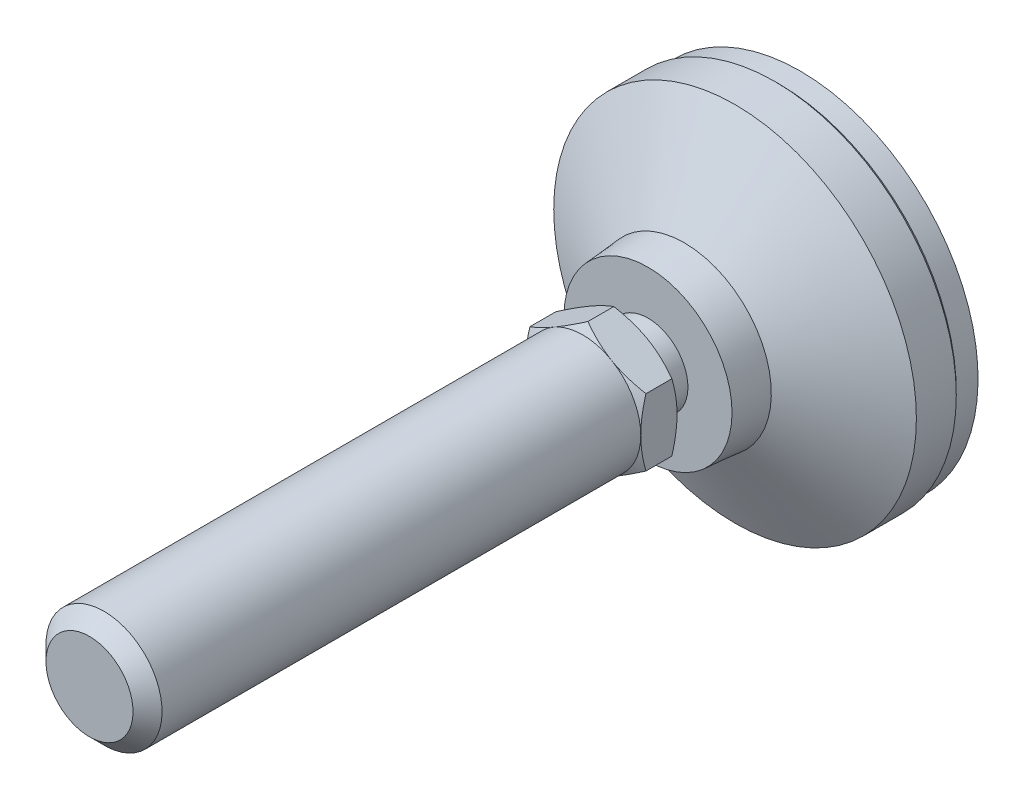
ISO-10303-21;
HEADER;
FILE_DESCRIPTION(('STEP AP214'),'2;1');
FILE_NAME('part.step','',(''),(''),'','','');
FILE_SCHEMA(('AUTOMOTIVE_DESIGN { 1 0 10303 214 1 1 1 1 }'));
ENDSEC;
DATA;
#1=APPLICATION_CONTEXT('core data for automotive mechanical design processes');
#2=APPLICATION_PROTOCOL_DEFINITION('international standard','automotive_design',2000,#1);
#3=PRODUCT_CONTEXT('',#1,'mechanical');
#4=PRODUCT('Part','Part','',(#3));
#5=PRODUCT_RELATED_PRODUCT_CATEGORY('part','',(#4));
#6=PRODUCT_DEFINITION_FORMATION('','',#4);
#7=PRODUCT_DEFINITION_CONTEXT('part definition',#1,'design');
#8=PRODUCT_DEFINITION('design','',#6,#7);
#9=PRODUCT_DEFINITION_SHAPE('','',#8);
#10=(LENGTH_UNIT() NAMED_UNIT(*) SI_UNIT(.MILLI.,.METRE.));
#11=(NAMED_UNIT(*) PLANE_ANGLE_UNIT() SI_UNIT($,.RADIAN.));
#12=(NAMED_UNIT(*) SI_UNIT($,.STERADIAN.) SOLID_ANGLE_UNIT());
#13=UNCERTAINTY_MEASURE_WITH_UNIT(LENGTH_MEASURE(1.E-05),#10,'distance_accuracy_value','');
#14=(GEOMETRIC_REPRESENTATION_CONTEXT(3) GLOBAL_UNCERTAINTY_ASSIGNED_CONTEXT((#13)) GLOBAL_UNIT_ASSIGNED_CONTEXT((#10,
#11,#12)) REPRESENTATION_CONTEXT('',''));
#15=CARTESIAN_POINT('',(0.,0.,0.));
#16=DIRECTION('',(0.,0.,1.));
#17=DIRECTION('',(1.,0.,0.));
#18=AXIS2_PLACEMENT_3D('',#15,#16,#17);
#19=CARTESIAN_POINT('',(0.,-5.50000000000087,24.9999999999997));
#20=DIRECTION('',(0.,0.,-1.));
#21=DIRECTION('',(0.,1.,0.));
#22=AXIS2_PLACEMENT_3D('',#19,#20,#21);
#23=PLANE('',#22);
#24=CARTESIAN_POINT('',(0.,0.,24.9999999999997));
#25=DIRECTION('',(0.,0.,-1.));
#26=DIRECTION('',(0.,1.,0.));
#27=AXIS2_PLACEMENT_3D('',#24,#25,#26);
#28=CIRCLE('',#27,8.00000000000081);
#29=CARTESIAN_POINT('',(-4.00000000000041,6.92820323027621,24.9999999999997));
#30=VERTEX_POINT('',#29);
#31=CARTESIAN_POINT('',(-8.00000000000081,0.,24.9999999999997));
#32=VERTEX_POINT('',#31);
#33=EDGE_CURVE('E9',#30,#32,#28,.F.);
#34=ORIENTED_EDGE('',*,*,#33,.F.);
#35=CARTESIAN_POINT('',(4.,6.92820323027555,24.9999999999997));
#36=VERTEX_POINT('',#35);
#37=EDGE_CURVE('E18',#36,#30,#28,.F.);
#38=ORIENTED_EDGE('',*,*,#37,.F.);
#39=CARTESIAN_POINT('',(8.00000000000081,0.,24.9999999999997));
#40=VERTEX_POINT('',#39);
#41=EDGE_CURVE('E125',#40,#36,#28,.F.);
#42=ORIENTED_EDGE('',*,*,#41,.F.);
#43=CARTESIAN_POINT('',(0.,0.,24.9999999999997));
#44=DIRECTION('',(0.,0.,1.));
#45=DIRECTION('',(0.,-1.,0.));
#46=AXIS2_PLACEMENT_3D('',#43,#44,#45);
#47=CIRCLE('',#46,8.00000000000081);
#48=CARTESIAN_POINT('',(4.00000000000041,-6.92820323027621,24.9999999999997));
#49=VERTEX_POINT('',#48);
#50=EDGE_CURVE('E614',#49,#40,#47,.T.);
#51=ORIENTED_EDGE('',*,*,#50,.F.);
#52=CARTESIAN_POINT('',(-4.00000000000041,-6.92820323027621,24.9999999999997));
#53=VERTEX_POINT('',#52);
#54=EDGE_CURVE('E616',#53,#49,#28,.F.);
#55=ORIENTED_EDGE('',*,*,#54,.F.);
#56=EDGE_CURVE('E23',#32,#53,#28,.F.);
#57=ORIENTED_EDGE('',*,*,#56,.F.);
#58=EDGE_LOOP('',(#34,#38,#42,#51,#55,#57));
#59=FACE_BOUND('',#58,.T.);
#60=CARTESIAN_POINT('',(0.,0.,24.9999999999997));
#61=DIRECTION('',(0.,0.,-1.));
#62=DIRECTION('',(0.,1.,0.));
#63=AXIS2_PLACEMENT_3D('',#60,#61,#62);
#64=CIRCLE('',#63,5.50000000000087);
#65=CARTESIAN_POINT('',(0.,5.50000000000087,24.9999999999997));
#66=VERTEX_POINT('',#65);
#67=EDGE_CURVE('E229',#66,#66,#64,.T.);
#68=ORIENTED_EDGE('',*,*,#67,.F.);
#69=EDGE_LOOP('',(#68));
#70=FACE_BOUND('',#69,.T.);
#71=ADVANCED_FACE('F14',(#59,#70),#23,.T.);
#72=CARTESIAN_POINT('',(0.,0.,2.));
#73=DIRECTION('',(0.,0.,-1.));
#74=DIRECTION('',(0.,1.,0.));
#75=AXIS2_PLACEMENT_3D('',#72,#73,#74);
#76=CYLINDRICAL_SURFACE('',#75,5.50000000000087);
#77=CARTESIAN_POINT('',(0.,0.,21.));
#78=DIRECTION('',(0.,0.,-1.));
#79=DIRECTION('',(0.,1.,0.));
#80=AXIS2_PLACEMENT_3D('',#77,#78,#79);
#81=CIRCLE('',#80,5.50000000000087);
#82=CARTESIAN_POINT('',(0.,5.50000000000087,21.));
#83=VERTEX_POINT('',#82);
#84=EDGE_CURVE('E232',#83,#83,#81,.T.);
#85=ORIENTED_EDGE('',*,*,#84,.F.);
#86=EDGE_LOOP('',(#85));
#87=FACE_BOUND('',#86,.T.);
#88=ORIENTED_EDGE('',*,*,#67,.T.);
#89=EDGE_LOOP('',(#88));
#90=FACE_BOUND('',#89,.T.);
#91=ADVANCED_FACE('F296',(#87,#90),#76,.T.);
#92=CARTESIAN_POINT('',(0.,-5.50000000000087,21.));
#93=DIRECTION('',(0.,0.,1.));
#94=DIRECTION('',(0.,-1.,0.));
#95=AXIS2_PLACEMENT_3D('',#92,#93,#94);
#96=PLANE('',#95);
#97=ORIENTED_EDGE('',*,*,#84,.T.);
#98=EDGE_LOOP('',(#97));
#99=FACE_BOUND('',#98,.T.);
#100=CARTESIAN_POINT('',(0.,0.,21.));
#101=DIRECTION('',(0.,0.,1.));
#102=DIRECTION('',(0.,-1.,0.));
#103=AXIS2_PLACEMENT_3D('',#100,#101,#102);
#104=CIRCLE('',#103,11.5833333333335);
#105=CARTESIAN_POINT('',(0.,-11.5833333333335,21.));
#106=VERTEX_POINT('',#105);
#107=EDGE_CURVE('E235',#106,#106,#104,.T.);
#108=ORIENTED_EDGE('',*,*,#107,.T.);
#109=EDGE_LOOP('',(#108));
#110=FACE_BOUND('',#109,.T.);
#111=ADVANCED_FACE('F199',(#99,#110),#96,.T.);
#112=CARTESIAN_POINT('',(0.,0.,2.));
#113=DIRECTION('',(0.,0.,-1.));
#114=DIRECTION('',(0.,1.,0.));
#115=AXIS2_PLACEMENT_3D('',#112,#113,#114);
#116=CYLINDRICAL_SURFACE('',#115,25.);
#117=CARTESIAN_POINT('',(0.,0.,3.5));
#118=DIRECTION('',(0.,0.,-1.));
#119=DIRECTION('',(0.,1.,0.));
#120=AXIS2_PLACEMENT_3D('',#117,#118,#119);
#121=CIRCLE('',#120,25.);
#122=CARTESIAN_POINT('',(0.,25.,3.5));
#123=VERTEX_POINT('',#122);
#124=EDGE_CURVE('E126',#123,#123,#121,.F.);
#125=ORIENTED_EDGE('',*,*,#124,.T.);
#126=EDGE_LOOP('',(#125));
#127=FACE_BOUND('',#126,.T.);
#128=CARTESIAN_POINT('',(0.,0.,8.9999999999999));
#129=DIRECTION('',(0.,0.,-1.));
#130=DIRECTION('',(0.,1.,0.));
#131=AXIS2_PLACEMENT_3D('',#128,#129,#130);
#132=CIRCLE('',#131,25.);
#133=CARTESIAN_POINT('',(0.,25.,8.9999999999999));
#134=VERTEX_POINT('',#133);
#135=EDGE_CURVE('E238',#134,#134,#132,.T.);
#136=ORIENTED_EDGE('',*,*,#135,.T.);
#137=EDGE_LOOP('',(#136));
#138=FACE_BOUND('',#137,.T.);
#139=ADVANCED_FACE('F275',(#127,#138),#116,.T.);
#140=CARTESIAN_POINT('',(0.,0.,16.));
#141=DIRECTION('',(0.,0.,-1.));
#142=DIRECTION('',(0.,1.,0.));
#143=AXIS2_PLACEMENT_3D('',#140,#141,#142);
#144=CONICAL_SURFACE('',#143,12.0000000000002,1.07685495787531);
#145=ORIENTED_EDGE('',*,*,#135,.F.);
#146=EDGE_LOOP('',(#145));
#147=FACE_BOUND('',#146,.T.);
#148=CARTESIAN_POINT('',(0.,0.,16.));
#149=DIRECTION('',(0.,0.,-1.));
#150=DIRECTION('',(0.,1.,0.));
#151=AXIS2_PLACEMENT_3D('',#148,#149,#150);
#152=CIRCLE('',#151,12.0000000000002);
#153=CARTESIAN_POINT('',(0.,12.0000000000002,16.));
#154=VERTEX_POINT('',#153);
#155=EDGE_CURVE('E254',#154,#154,#152,.T.);
#156=ORIENTED_EDGE('',*,*,#155,.T.);
#157=EDGE_LOOP('',(#156));
#158=FACE_BOUND('',#157,.T.);
#159=ADVANCED_FACE('F518',(#147,#158),#144,.T.);
#160=CARTESIAN_POINT('',(0.,0.,22.));
#161=DIRECTION('',(0.,0.,-1.));
#162=DIRECTION('',(0.,1.,0.));
#163=AXIS2_PLACEMENT_3D('',#160,#161,#162);
#164=CONICAL_SURFACE('',#163,11.5000000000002,0.0831412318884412);
#165=ORIENTED_EDGE('',*,*,#155,.F.);
#166=EDGE_LOOP('',(#165));
#167=FACE_BOUND('',#166,.T.);
#168=ORIENTED_EDGE('',*,*,#107,.F.);
#169=EDGE_LOOP('',(#168));
#170=FACE_BOUND('',#169,.T.);
#171=ADVANCED_FACE('F281',(#167,#170),#164,.T.);
#172=CARTESIAN_POINT('',(0.,0.,3.));
#173=DIRECTION('',(0.,0.,1.));
#174=DIRECTION('',(0.,-1.,0.));
#175=AXIS2_PLACEMENT_3D('',#172,#173,#174);
#176=CONICAL_SURFACE('',#175,24.5,0.785398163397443);
#177=ORIENTED_EDGE('',*,*,#124,.F.);
#178=EDGE_LOOP('',(#177));
#179=FACE_BOUND('',#178,.T.);
#180=CARTESIAN_POINT('',(0.,0.,3.));
#181=DIRECTION('',(0.,0.,-1.));
#182=DIRECTION('',(0.,1.,0.));
#183=AXIS2_PLACEMENT_3D('',#180,#181,#182);
#184=CIRCLE('',#183,24.5);
#185=CARTESIAN_POINT('',(0.,24.5,3.));
#186=VERTEX_POINT('',#185);
#187=EDGE_CURVE('E270',#186,#186,#184,.T.);
#188=ORIENTED_EDGE('',*,*,#187,.F.);
#189=EDGE_LOOP('',(#188));
#190=FACE_BOUND('',#189,.T.);
#191=ADVANCED_FACE('F16',(#179,#190),#176,.T.);
#192=CARTESIAN_POINT('',(0.,0.,0.));
#193=DIRECTION('',(0.,0.,1.));
#194=DIRECTION('',(0.,-1.,0.));
#195=AXIS2_PLACEMENT_3D('',#192,#193,#194);
#196=CYLINDRICAL_SURFACE('',#195,24.5);
#197=CARTESIAN_POINT('',(0.,0.,0.));
#198=DIRECTION('',(0.,0.,-1.));
#199=DIRECTION('',(0.,1.,0.));
#200=AXIS2_PLACEMENT_3D('',#197,#198,#199);
#201=CIRCLE('',#200,24.5);
#202=CARTESIAN_POINT('',(0.,24.5,0.));
#203=VERTEX_POINT('',#202);
#204=EDGE_CURVE('E226',#203,#203,#201,.T.);
#205=ORIENTED_EDGE('',*,*,#204,.F.);
#206=EDGE_LOOP('',(#205));
#207=FACE_BOUND('',#206,.T.);
#208=ORIENTED_EDGE('',*,*,#187,.T.);
#209=EDGE_LOOP('',(#208));
#210=FACE_BOUND('',#209,.T.);
#211=ADVANCED_FACE('F280',(#207,#210),#196,.T.);
#212=CARTESIAN_POINT('',(0.,0.,0.));
#213=DIRECTION('',(0.,0.,-1.));
#214=DIRECTION('',(0.,1.,0.));
#215=AXIS2_PLACEMENT_3D('',#212,#213,#214);
#216=PLANE('',#215);
#217=ORIENTED_EDGE('',*,*,#204,.T.);
#218=EDGE_LOOP('',(#217));
#219=FACE_BOUND('',#218,.T.);
#220=ADVANCED_FACE('F285',(#219),#216,.T.);
#221=CARTESIAN_POINT('',(0.,0.,24.9999999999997));
#222=DIRECTION('',(0.,0.,1.));
#223=DIRECTION('',(0.,-1.,0.));
#224=AXIS2_PLACEMENT_3D('',#221,#222,#223);
#225=CONICAL_SURFACE('',#224,8.00000000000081,1.0471975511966);
#226=CARTESIAN_POINT('',(-8.0002,4.61868668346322,25.7145978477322));
#227=CARTESIAN_POINT('',(-7.82435121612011,4.72021302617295,25.6559907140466));
#228=CARTESIAN_POINT('',(-7.64784680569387,4.82211789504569,25.6000434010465));
#229=CARTESIAN_POINT('',(-7.29340453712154,5.02675523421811,25.4942010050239));
#230=CARTESIAN_POINT('',(-7.11546609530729,5.12948804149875,25.4443085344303));
#231=CARTESIAN_POINT('',(-6.57880176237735,5.43933133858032,25.3046927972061));
#232=CARTESIAN_POINT('',(-6.21795741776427,5.64766491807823,25.2252811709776));
#233=CARTESIAN_POINT('',(-5.67796082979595,5.95943209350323,25.1321616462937));
#234=CARTESIAN_POINT('',(-5.50042181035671,6.06193429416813,25.1056345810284));
#235=CARTESIAN_POINT('',(-5.1445408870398,6.2674022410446,25.0611531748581));
#236=CARTESIAN_POINT('',(-4.96619905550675,6.37036794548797,25.0431980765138));
#237=CARTESIAN_POINT('',(-4.6092083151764,6.57647664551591,25.0163156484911));
#238=CARTESIAN_POINT('',(-4.43055998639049,6.67961930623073,25.0073780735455));
#239=CARTESIAN_POINT('',(-4.07309829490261,6.88599991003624,24.9987223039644));
#240=CARTESIAN_POINT('',(-3.89428493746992,6.9892378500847,24.9990038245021));
#241=CARTESIAN_POINT('',(-3.55998663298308,7.18224506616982,25.0081450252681));
#242=CARTESIAN_POINT('',(-3.40447809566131,7.27202796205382,25.0158896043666));
#243=CARTESIAN_POINT('',(-3.09382523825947,7.4513834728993,25.0382011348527));
#244=CARTESIAN_POINT('',(-2.93868094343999,7.54095607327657,25.0527685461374));
#245=CARTESIAN_POINT('',(-2.47384868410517,7.80932710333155,25.1063606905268));
#246=CARTESIAN_POINT('',(-2.16498351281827,7.98765049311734,25.1552686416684));
#247=CARTESIAN_POINT('',(-1.54397677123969,8.3461889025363,25.2775394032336));
#248=CARTESIAN_POINT('',(-1.23191445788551,8.52635816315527,25.3514205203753));
#249=CARTESIAN_POINT('',(-0.612443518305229,8.8840098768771,25.5191001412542));
#250=CARTESIAN_POINT('',(-0.305026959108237,9.06149691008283,25.6128592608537));
#251=CARTESIAN_POINT('',(0.000200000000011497,9.23771977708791,25.7145978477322));
#252=B_SPLINE_CURVE_WITH_KNOTS('',3,(#226,#227,#228,#229,#230,#231,#232,#233,#234,#235,#236,
#237,#238,#239,#240,#241,#242,#243,#244,#245,#246,#247,#248,#249,#250,#251),.UNSPECIFIED.,.F.,
.F.,(4,2,2,2,2,2,2,2,2,2,2,2,4),(0.,0.633973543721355,1.26821965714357,2.53934712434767,
3.1593434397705,3.77928496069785,4.39852133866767,5.01773858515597,5.55680239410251,
6.0959025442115,7.17487077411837,8.27776850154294,9.37850115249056),.UNSPECIFIED.);
#253=CARTESIAN_POINT('',(0.,9.23760430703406,25.7145311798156));
#254=VERTEX_POINT('',#253);
#255=EDGE_CURVE('E115',#30,#254,#252,.T.);
#256=ORIENTED_EDGE('',*,*,#255,.T.);
#257=CARTESIAN_POINT('',(-0.000199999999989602,9.2377197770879,25.7145978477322));
#258=CARTESIAN_POINT('',(0.175648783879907,9.13619343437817,25.6559907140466));
#259=CARTESIAN_POINT('',(0.352153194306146,9.03428856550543,25.6000434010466));
#260=CARTESIAN_POINT('',(0.706595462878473,8.82965122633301,25.4942010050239));
#261=CARTESIAN_POINT('',(0.884533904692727,8.72691841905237,25.4443085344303));
#262=CARTESIAN_POINT('',(1.42119823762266,8.4170751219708,25.3046927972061));
#263=CARTESIAN_POINT('',(1.78204258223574,8.20874154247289,25.2252811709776));
#264=CARTESIAN_POINT('',(2.32203917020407,7.89697436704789,25.1321616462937));
#265=CARTESIAN_POINT('',(2.49957818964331,7.79447216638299,25.1056345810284));
#266=CARTESIAN_POINT('',(2.85545911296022,7.58900421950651,25.0611531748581));
#267=CARTESIAN_POINT('',(3.03380094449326,7.48603851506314,25.0431980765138));
#268=CARTESIAN_POINT('',(3.39079168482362,7.27992981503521,25.0163156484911));
#269=CARTESIAN_POINT('',(3.56944001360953,7.17678715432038,25.0073780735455));
#270=CARTESIAN_POINT('',(3.92690170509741,6.97040655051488,24.9987223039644));
#271=CARTESIAN_POINT('',(4.1057150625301,6.86716861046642,24.9990038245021));
#272=CARTESIAN_POINT('',(4.44001336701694,6.67416139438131,25.0081450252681));
#273=CARTESIAN_POINT('',(4.5955219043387,6.5843784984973,25.0158896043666));
#274=CARTESIAN_POINT('',(4.90617476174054,6.40502298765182,25.0382011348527));
#275=CARTESIAN_POINT('',(5.06131905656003,6.31545038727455,25.0527685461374));
#276=CARTESIAN_POINT('',(5.52615131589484,6.04707935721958,25.1063606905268));
#277=CARTESIAN_POINT('',(5.83501648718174,5.86875596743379,25.1552686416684));
#278=CARTESIAN_POINT('',(6.45602322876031,5.51021755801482,25.2775394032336));
#279=CARTESIAN_POINT('',(6.76808554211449,5.33004829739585,25.3514205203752));
#280=CARTESIAN_POINT('',(7.38755648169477,4.97239658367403,25.5191001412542));
#281=CARTESIAN_POINT('',(7.69497304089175,4.7949095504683,25.6128592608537));
#282=CARTESIAN_POINT('',(8.0002,4.61868668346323,25.7145978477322));
#283=B_SPLINE_CURVE_WITH_KNOTS('',3,(#257,#258,#259,#260,#261,#262,#263,#264,#265,#266,#267,
#268,#269,#270,#271,#272,#273,#274,#275,#276,#277,#278,#279,#280,#281,#282),.UNSPECIFIED.,.F.,
.F.,(4,2,2,2,2,2,2,2,2,2,2,2,4),(0.,0.633973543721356,1.26821965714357,2.53934712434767,
3.1593434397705,3.77928496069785,4.39852133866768,5.01773858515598,5.55680239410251,
6.09590254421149,7.17487077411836,8.27776850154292,9.37850115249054),.UNSPECIFIED.);
#284=EDGE_CURVE('E121',#254,#36,#283,.T.);
#285=ORIENTED_EDGE('',*,*,#284,.T.);
#286=ORIENTED_EDGE('',*,*,#37,.T.);
#287=EDGE_LOOP('',(#256,#285,#286));
#288=FACE_BOUND('',#287,.T.);
#289=ADVANCED_FACE('F119',(#288),#225,.T.);
#290=CARTESIAN_POINT('',(8.,12.3641693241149,28.8836030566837));
#291=CARTESIAN_POINT('',(8.,12.0151166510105,28.7144525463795));
#292=CARTESIAN_POINT('',(8.,11.6652581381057,28.5469362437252));
#293=CARTESIAN_POINT('',(8.,10.9635007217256,28.216092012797));
#294=CARTESIAN_POINT('',(8.,10.6116015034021,28.0527647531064));
#295=CARTESIAN_POINT('',(8.,9.90350034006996,27.7303877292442));
#296=CARTESIAN_POINT('',(8.,9.54728537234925,27.571366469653));
#297=CARTESIAN_POINT('',(8.,8.83200743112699,27.2598884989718));
#298=CARTESIAN_POINT('',(8.,8.47294459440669,27.10743147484));
#299=CARTESIAN_POINT('',(8.,7.73996270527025,26.8061149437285));
#300=CARTESIAN_POINT('',(8.,7.36593332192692,26.6575223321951));
#301=CARTESIAN_POINT('',(8.,6.61348385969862,26.3716863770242));
#302=CARTESIAN_POINT('',(8.,6.23506329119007,26.2344443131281));
#303=CARTESIAN_POINT('',(8.,5.47394703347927,25.9749440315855));
#304=CARTESIAN_POINT('',(8.,5.09126192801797,25.8526551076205));
#305=CARTESIAN_POINT('',(8.,4.32041642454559,25.6270115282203));
#306=CARTESIAN_POINT('',(8.,3.93225780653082,25.5236508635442));
#307=CARTESIAN_POINT('',(8.,3.15233287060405,25.3414081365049));
#308=CARTESIAN_POINT('',(8.,2.76059814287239,25.2623945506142));
#309=CARTESIAN_POINT('',(8.,2.16946296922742,25.1655749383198));
#310=CARTESIAN_POINT('',(8.,1.97181418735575,25.1369172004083));
#311=CARTESIAN_POINT('',(8.,1.5755487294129,25.0873983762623));
#312=CARTESIAN_POINT('',(8.,1.37693214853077,25.0665365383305));
#313=CARTESIAN_POINT('',(8.,0.981572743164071,25.0332845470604));
#314=CARTESIAN_POINT('',(8.,0.784838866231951,25.0207884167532));
#315=CARTESIAN_POINT('',(8.,0.391019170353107,25.004123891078));
#316=CARTESIAN_POINT('',(8.,0.193933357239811,24.9999553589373));
#317=CARTESIAN_POINT('',(8.,-0.200238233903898,25.0000453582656));
#318=CARTESIAN_POINT('',(8.,-0.39732401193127,25.0043039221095));
#319=CARTESIAN_POINT('',(8.,-0.79114218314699,25.0211447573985));
#320=CARTESIAN_POINT('',(8.,-0.987874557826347,25.0337274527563));
#321=CARTESIAN_POINT('',(8.,-1.46199048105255,25.0738169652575));
#322=CARTESIAN_POINT('',(8.,-1.73904096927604,25.1053459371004));
#323=CARTESIAN_POINT('',(8.,-2.2910445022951,25.1831820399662));
#324=CARTESIAN_POINT('',(8.,-2.5659972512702,25.229491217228));
#325=CARTESIAN_POINT('',(8.,-3.38741855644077,25.3881299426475));
#326=CARTESIAN_POINT('',(8.,-3.93013417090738,25.5201404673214));
#327=CARTESIAN_POINT('',(8.,-4.74155771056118,25.7485350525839));
#328=CARTESIAN_POINT('',(8.,-5.01448799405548,25.830776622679));
#329=CARTESIAN_POINT('',(8.,-5.55769691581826,26.0036723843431));
#330=CARTESIAN_POINT('',(8.,-5.82797553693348,26.094326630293));
#331=CARTESIAN_POINT('',(8.,-6.36596840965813,26.2826040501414));
#332=CARTESIAN_POINT('',(8.,-6.6336835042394,26.3802248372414));
#333=CARTESIAN_POINT('',(8.,-7.16690462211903,26.5812996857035));
#334=CARTESIAN_POINT('',(8.,-7.43241066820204,26.6847536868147));
#335=CARTESIAN_POINT('',(8.,-8.04598174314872,26.9303574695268));
#336=CARTESIAN_POINT('',(8.,-8.39332346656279,27.0743105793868));
#337=CARTESIAN_POINT('',(8.,-9.08515313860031,27.3689372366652));
#338=CARTESIAN_POINT('',(8.,-9.42964092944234,27.5196111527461));
#339=CARTESIAN_POINT('',(8.,-10.116269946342,27.8263669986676));
#340=CARTESIAN_POINT('',(8.,-10.4584107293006,27.9824499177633));
#341=CARTESIAN_POINT('',(8.,-11.1406749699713,28.2989717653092));
#342=CARTESIAN_POINT('',(8.,-11.4807983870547,28.4594107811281));
#343=CARTESIAN_POINT('',(8.,-12.1596813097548,28.784007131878));
#344=CARTESIAN_POINT('',(8.,-12.4984391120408,28.9481680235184));
#345=CARTESIAN_POINT('',(8.,-13.1745126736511,29.2794354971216));
#346=CARTESIAN_POINT('',(8.,-13.5118284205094,29.4465421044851));
#347=CARTESIAN_POINT('',(8.,-14.5218661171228,29.9514748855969));
#348=CARTESIAN_POINT('',(8.,-15.1927617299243,30.2929541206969));
#349=CARTESIAN_POINT('',(8.,-16.4769705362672,30.95497524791));
#350=CARTESIAN_POINT('',(8.,-17.090560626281,31.2749823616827));
#351=CARTESIAN_POINT('',(8.,-18.3154373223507,31.9194194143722));
#352=CARTESIAN_POINT('',(8.,-18.9267238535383,32.2438494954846));
#353=CARTESIAN_POINT('',(8.,-20.146053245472,32.8953241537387));
#354=CARTESIAN_POINT('',(8.,-20.7541003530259,33.2223607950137));
#355=CARTESIAN_POINT('',(8.,-21.96871356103,33.8790985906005));
#356=CARTESIAN_POINT('',(8.,-22.5752797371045,34.2087996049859));
#357=CARTESIAN_POINT('',(8.,-23.1812970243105,34.5394996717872));
#358=B_SPLINE_CURVE_WITH_KNOTS('',3,(#290,#291,#292,#293,#294,#295,#296,#297,#298,#299,#300,
#301,#302,#303,#304,#305,#306,#307,#308,#309,#310,#311,#312,#313,#314,#315,#316,#317,#318,#319,
#320,#321,#322,#323,#324,#325,#326,#327,#328,#329,#330,#331,#332,#333,#334,#335,#336,#337,#338,
#339,#340,#341,#342,#343,#344,#345,#346,#347,#348,#349,#350,#351,#352,#353,#354,#355,#356,#357),
.UNSPECIFIED.,.F.,.F.,(4,2,2,2,2,2,2,2,2,2,2,2,2,2,2,2,2,2,2,2,2,2,2,2,2,2,2,2,2,2,2,2,2,4),(0.,
1.16364965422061,2.32748388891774,3.49772643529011,4.66791311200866,5.87516395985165,
7.08255073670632,8.28741494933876,9.49189598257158,10.6897514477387,11.2887685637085,
11.8877279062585,12.4789483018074,13.0701589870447,13.6613719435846,14.2526150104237,
15.0886578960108,15.9248165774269,17.598082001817,18.453168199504,19.3082599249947,
20.1630600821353,21.0178514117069,22.1457287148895,23.2736679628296,24.4018146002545,
25.5299838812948,26.6592809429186,27.7885877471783,30.0469242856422,32.1229772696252,
34.1990971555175,36.2703380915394,38.3414709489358),.UNSPECIFIED.);
#359=CARTESIAN_POINT('',(8.,4.61880215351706,25.7145311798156));
#360=VERTEX_POINT('',#359);
#361=EDGE_CURVE('E134',#360,#40,#358,.T.);
#362=ORIENTED_EDGE('',*,*,#361,.T.);
#363=ORIENTED_EDGE('',*,*,#41,.T.);
#364=EDGE_CURVE('E171',#36,#360,#283,.T.);
#365=ORIENTED_EDGE('',*,*,#364,.T.);
#366=EDGE_LOOP('',(#362,#363,#365));
#367=FACE_BOUND('',#366,.T.);
#368=ADVANCED_FACE('F159',(#367),#225,.T.);
#369=CARTESIAN_POINT('',(8.0002,-4.61868668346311,25.7145978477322));
#370=CARTESIAN_POINT('',(7.82435121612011,-4.72021302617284,25.6559907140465));
#371=CARTESIAN_POINT('',(7.64784680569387,-4.82211789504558,25.6000434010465));
#372=CARTESIAN_POINT('',(7.29340453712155,-5.02675523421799,25.4942010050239));
#373=CARTESIAN_POINT('',(7.1154660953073,-5.12948804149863,25.4443085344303));
#374=CARTESIAN_POINT('',(6.57880176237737,-5.4393313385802,25.3046927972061));
#375=CARTESIAN_POINT('',(6.21795741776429,-5.64766491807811,25.2252811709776));
#376=CARTESIAN_POINT('',(5.67796082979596,-5.95943209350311,25.1321616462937));
#377=CARTESIAN_POINT('',(5.50042181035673,-6.06193429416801,25.1056345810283));
#378=CARTESIAN_POINT('',(5.14454088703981,-6.26740224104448,25.0611531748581));
#379=CARTESIAN_POINT('',(4.96619905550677,-6.37036794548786,25.0431980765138));
#380=CARTESIAN_POINT('',(4.60920831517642,-6.57647664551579,25.0163156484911));
#381=CARTESIAN_POINT('',(4.43055998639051,-6.67961930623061,25.0073780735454));
#382=CARTESIAN_POINT('',(4.07309829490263,-6.88599991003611,24.9987223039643));
#383=CARTESIAN_POINT('',(3.89428493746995,-6.98923785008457,24.999003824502));
#384=CARTESIAN_POINT('',(3.55998663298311,-7.18224506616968,25.008145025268));
#385=CARTESIAN_POINT('',(3.40447809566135,-7.27202796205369,25.0158896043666));
#386=CARTESIAN_POINT('',(3.09382523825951,-7.45138347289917,25.0382011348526));
#387=CARTESIAN_POINT('',(2.93868094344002,-7.54095607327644,25.0527685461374));
#388=CARTESIAN_POINT('',(2.4738486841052,-7.80932710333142,25.1063606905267));
#389=CARTESIAN_POINT('',(2.1649835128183,-7.98765049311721,25.1552686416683));
#390=CARTESIAN_POINT('',(1.54397677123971,-8.34618890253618,25.2775394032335));
#391=CARTESIAN_POINT('',(1.23191445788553,-8.52635816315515,25.3514205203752));
#392=CARTESIAN_POINT('',(0.612443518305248,-8.88400987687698,25.5191001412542));
#393=CARTESIAN_POINT('',(0.305026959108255,-9.06149691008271,25.6128592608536));
#394=CARTESIAN_POINT('',(-0.000199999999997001,-9.23771977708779,25.7145978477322));
#395=B_SPLINE_CURVE_WITH_KNOTS('',3,(#369,#370,#371,#372,#373,#374,#375,#376,#377,#378,#379,
#380,#381,#382,#383,#384,#385,#386,#387,#388,#389,#390,#391,#392,#393,#394),.UNSPECIFIED.,.F.,
.F.,(4,2,2,2,2,2,2,2,2,2,2,2,4),(0.,0.633973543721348,1.26821965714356,2.53934712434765,
3.15934343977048,3.77928496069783,4.39852133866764,5.01773858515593,5.55680239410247,
6.09590254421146,7.17487077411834,8.27776850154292,9.37850115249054),.UNSPECIFIED.);
#396=CARTESIAN_POINT('',(8.,-4.61880215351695,25.7145311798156));
#397=VERTEX_POINT('',#396);
#398=EDGE_CURVE('E149',#397,#49,#395,.T.);
#399=ORIENTED_EDGE('',*,*,#398,.T.);
#400=ORIENTED_EDGE('',*,*,#50,.T.);
#401=EDGE_CURVE('E114',#40,#397,#358,.T.);
#402=ORIENTED_EDGE('',*,*,#401,.T.);
#403=EDGE_LOOP('',(#399,#400,#402));
#404=FACE_BOUND('',#403,.T.);
#405=ADVANCED_FACE('F163',(#404),#225,.T.);
#406=CARTESIAN_POINT('',(0.000200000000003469,-9.23771977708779,25.7145978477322));
#407=CARTESIAN_POINT('',(-0.175648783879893,-9.13619343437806,25.6559907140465));
#408=CARTESIAN_POINT('',(-0.352153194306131,-9.03428856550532,25.6000434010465));
#409=CARTESIAN_POINT('',(-0.706595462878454,-8.8296512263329,25.4942010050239));
#410=CARTESIAN_POINT('',(-0.884533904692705,-8.72691841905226,25.4443085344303));
#411=CARTESIAN_POINT('',(-1.42119823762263,-8.4170751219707,25.3046927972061));
#412=CARTESIAN_POINT('',(-1.78204258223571,-8.20874154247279,25.2252811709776));
#413=CARTESIAN_POINT('',(-2.32203917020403,-7.89697436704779,25.1321616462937));
#414=CARTESIAN_POINT('',(-2.49957818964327,-7.79447216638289,25.1056345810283));
#415=CARTESIAN_POINT('',(-2.85545911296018,-7.58900421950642,25.0611531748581));
#416=CARTESIAN_POINT('',(-3.03380094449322,-7.48603851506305,25.0431980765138));
#417=CARTESIAN_POINT('',(-3.39079168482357,-7.27992981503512,25.0163156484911));
#418=CARTESIAN_POINT('',(-3.56944001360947,-7.1767871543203,25.0073780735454));
#419=CARTESIAN_POINT('',(-3.92690170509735,-6.97040655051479,24.9987223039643));
#420=CARTESIAN_POINT('',(-4.10571506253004,-6.86716861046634,24.999003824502));
#421=CARTESIAN_POINT('',(-4.44001336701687,-6.67416139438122,25.008145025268));
#422=CARTESIAN_POINT('',(-4.59552190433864,-6.58437849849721,25.0158896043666));
#423=CARTESIAN_POINT('',(-4.90617476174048,-6.40502298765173,25.0382011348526));
#424=CARTESIAN_POINT('',(-5.06131905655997,-6.31545038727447,25.0527685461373));
#425=CARTESIAN_POINT('',(-5.52615131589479,-6.04707935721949,25.1063606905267));
#426=CARTESIAN_POINT('',(-5.8350164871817,-5.86875596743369,25.1552686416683));
#427=CARTESIAN_POINT('',(-6.45602322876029,-5.51021755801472,25.2775394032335));
#428=CARTESIAN_POINT('',(-6.76808554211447,-5.33004829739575,25.3514205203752));
#429=CARTESIAN_POINT('',(-7.38755648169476,-4.97239658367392,25.5191001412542));
#430=CARTESIAN_POINT('',(-7.69497304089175,-4.79490955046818,25.6128592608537));
#431=CARTESIAN_POINT('',(-8.0002,-4.6186866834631,25.7145978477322));
#432=B_SPLINE_CURVE_WITH_KNOTS('',3,(#406,#407,#408,#409,#410,#411,#412,#413,#414,#415,#416,
#417,#418,#419,#420,#421,#422,#423,#424,#425,#426,#427,#428,#429,#430,#431),.UNSPECIFIED.,.F.,
.F.,(4,2,2,2,2,2,2,2,2,2,2,2,4),(0.,0.633973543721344,1.26821965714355,2.53934712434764,
3.15934343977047,3.77928496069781,4.39852133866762,5.01773858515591,5.55680239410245,
6.09590254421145,7.17487077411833,8.27776850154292,9.37850115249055),.UNSPECIFIED.);
#433=CARTESIAN_POINT('',(0.,-9.23760430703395,25.7145311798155));
#434=VERTEX_POINT('',#433);
#435=EDGE_CURVE('E37',#434,#53,#432,.T.);
#436=ORIENTED_EDGE('',*,*,#435,.T.);
#437=ORIENTED_EDGE('',*,*,#54,.T.);
#438=EDGE_CURVE('E557',#49,#434,#395,.T.);
#439=ORIENTED_EDGE('',*,*,#438,.T.);
#440=EDGE_LOOP('',(#436,#437,#439));
#441=FACE_BOUND('',#440,.T.);
#442=ADVANCED_FACE('F165',(#441),#225,.T.);
#443=CARTESIAN_POINT('',(-8.,-4.61880215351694,25.7145311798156));
#444=VERTEX_POINT('',#443);
#445=EDGE_CURVE('E186',#53,#444,#432,.T.);
#446=ORIENTED_EDGE('',*,*,#445,.T.);
#447=CARTESIAN_POINT('',(-8.,12.3641693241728,28.8836030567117));
#448=CARTESIAN_POINT('',(-8.,12.0151166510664,28.7144525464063));
#449=CARTESIAN_POINT('',(-8.00000000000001,11.6652581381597,28.5469362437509));
#450=CARTESIAN_POINT('',(-8.00000000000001,10.9635007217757,28.2160920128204));
#451=CARTESIAN_POINT('',(-8.00000000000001,10.6116015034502,28.0527647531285));
#452=CARTESIAN_POINT('',(-8.00000000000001,9.90350034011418,27.730387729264));
#453=CARTESIAN_POINT('',(-8.00000000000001,9.54728537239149,27.5713664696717));
#454=CARTESIAN_POINT('',(-8.00000000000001,8.83200743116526,27.2598884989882));
#455=CARTESIAN_POINT('',(-8.00000000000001,8.47294459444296,27.1074314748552));
#456=CARTESIAN_POINT('',(-8.00000000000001,7.73996270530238,26.8061149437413));
#457=CARTESIAN_POINT('',(-8.00000000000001,7.36593332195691,26.6575223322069));
#458=CARTESIAN_POINT('',(-8.00000000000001,6.61348385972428,26.3716863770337));
#459=CARTESIAN_POINT('',(-8.,6.23506329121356,26.2344443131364));
#460=CARTESIAN_POINT('',(-8.,5.47394703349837,25.9749440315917));
#461=CARTESIAN_POINT('',(-8.00000000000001,5.09126192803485,25.8526551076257));
#462=CARTESIAN_POINT('',(-8.,4.32041642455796,25.6270115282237));
#463=CARTESIAN_POINT('',(-8.,3.9322578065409,25.5236508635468));
#464=CARTESIAN_POINT('',(-8.,3.15233287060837,25.3414081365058));
#465=CARTESIAN_POINT('',(-8.,2.76059814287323,25.2623945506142));
#466=CARTESIAN_POINT('',(-8.,2.16946296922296,25.1655749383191));
#467=CARTESIAN_POINT('',(-8.,1.97181418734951,25.1369172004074));
#468=CARTESIAN_POINT('',(-8.,1.57554872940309,25.0873983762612));
#469=CARTESIAN_POINT('',(-8.,1.37693214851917,25.0665365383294));
#470=CARTESIAN_POINT('',(-8.,0.981572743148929,25.0332845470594));
#471=CARTESIAN_POINT('',(-8.,0.784838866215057,25.0207884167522));
#472=CARTESIAN_POINT('',(-8.,0.391019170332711,25.0041238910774));
#473=CARTESIAN_POINT('',(-8.,0.193933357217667,24.999955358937));
#474=CARTESIAN_POINT('',(-8.,-0.200238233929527,25.0000453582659));
#475=CARTESIAN_POINT('',(-8.,-0.397324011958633,25.0043039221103));
#476=CARTESIAN_POINT('',(-8.,-0.7911421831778,25.0211447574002));
#477=CARTESIAN_POINT('',(-8.,-0.987874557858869,25.0337274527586));
#478=CARTESIAN_POINT('',(-8.,-1.46199048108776,25.0738169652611));
#479=CARTESIAN_POINT('',(-8.,-1.73904096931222,25.1053459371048));
#480=CARTESIAN_POINT('',(-8.,-2.29104450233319,25.1831820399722));
#481=CARTESIAN_POINT('',(-8.,-2.56599725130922,25.2294912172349));
#482=CARTESIAN_POINT('',(-8.,-3.38741855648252,25.3881299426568));
#483=CARTESIAN_POINT('',(-8.,-3.93013417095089,25.5201404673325));
#484=CARTESIAN_POINT('',(-8.,-4.74155771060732,25.7485350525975));
#485=CARTESIAN_POINT('',(-8.,-5.01448799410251,25.8307766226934));
#486=CARTESIAN_POINT('',(-8.,-5.55769691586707,26.0036723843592));
#487=CARTESIAN_POINT('',(-8.,-5.82797553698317,26.0943266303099));
#488=CARTESIAN_POINT('',(-8.,-6.36596840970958,26.2826040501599));
#489=CARTESIAN_POINT('',(-8.,-6.63368350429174,26.3802248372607));
#490=CARTESIAN_POINT('',(-8.,-7.16690462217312,26.5812996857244));
#491=CARTESIAN_POINT('',(-8.,-7.43241066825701,26.6847536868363));
#492=CARTESIAN_POINT('',(-8.,-8.04598174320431,26.9303574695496));
#493=CARTESIAN_POINT('',(-8.,-8.39332346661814,27.07431057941));
#494=CARTESIAN_POINT('',(-8.,-9.0851531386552,27.368937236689));
#495=CARTESIAN_POINT('',(-8.,-9.42964092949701,27.5196111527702));
#496=CARTESIAN_POINT('',(-8.,-10.1162699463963,27.8263669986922));
#497=CARTESIAN_POINT('',(-8.,-10.4584107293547,27.9824499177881));
#498=CARTESIAN_POINT('',(-8.,-11.140674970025,28.2989717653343));
#499=CARTESIAN_POINT('',(-8.,-11.4807983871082,28.4594107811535));
#500=CARTESIAN_POINT('',(-8.,-12.159681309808,28.7840071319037));
#501=CARTESIAN_POINT('',(-8.,-12.4984391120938,28.9481680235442));
#502=CARTESIAN_POINT('',(-8.,-13.1745126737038,29.2794354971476));
#503=CARTESIAN_POINT('',(-8.,-13.511828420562,29.4465421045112));
#504=CARTESIAN_POINT('',(-8.,-14.521866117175,29.9514748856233));
#505=CARTESIAN_POINT('',(-8.,-15.1927617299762,30.2929541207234));
#506=CARTESIAN_POINT('',(-8.,-16.4769705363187,30.9549752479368));
#507=CARTESIAN_POINT('',(-7.99999999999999,-17.0905606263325,31.2749823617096));
#508=CARTESIAN_POINT('',(-7.99999999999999,-18.3154373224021,31.9194194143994));
#509=CARTESIAN_POINT('',(-7.99999999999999,-18.9267238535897,32.2438494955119));
#510=CARTESIAN_POINT('',(-7.99999999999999,-20.1460532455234,32.8953241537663));
#511=CARTESIAN_POINT('',(-7.99999999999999,-20.7541003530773,33.2223607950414));
#512=CARTESIAN_POINT('',(-7.99999999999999,-21.9687135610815,33.8790985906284));
#513=CARTESIAN_POINT('',(-7.99999999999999,-22.5752797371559,34.2087996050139));
#514=CARTESIAN_POINT('',(-8.,-23.181297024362,34.5394996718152));
#515=B_SPLINE_CURVE_WITH_KNOTS('',3,(#447,#448,#449,#450,#451,#452,#453,#454,#455,#456,#457,
#458,#459,#460,#461,#462,#463,#464,#465,#466,#467,#468,#469,#470,#471,#472,#473,#474,#475,#476,
#477,#478,#479,#480,#481,#482,#483,#484,#485,#486,#487,#488,#489,#490,#491,#492,#493,#494,#495,
#496,#497,#498,#499,#500,#501,#502,#503,#504,#505,#506,#507,#508,#509,#510,#511,#512,#513,#514),
.UNSPECIFIED.,.F.,.F.,(4,2,2,2,2,2,2,2,2,2,2,2,2,2,2,2,2,2,2,2,2,2,2,2,2,2,2,2,2,2,2,2,2,4),(0.,
1.1636496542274,2.32748388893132,3.49772643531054,4.66791311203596,5.87516395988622,
7.08255073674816,8.28741494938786,9.49189598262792,10.6897514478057,11.2887685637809,
11.8877279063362,12.4789483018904,13.0701589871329,13.661371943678,14.2526150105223,
15.0886578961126,15.9248165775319,17.5980820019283,18.4531681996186,19.3082599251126,
20.1630600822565,21.0178514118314,22.1457287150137,23.2736679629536,24.4018146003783,
25.5299838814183,26.6592809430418,27.7885877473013,30.0469242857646,32.1229772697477,
34.1990971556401,36.2703380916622,38.3414709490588),.UNSPECIFIED.);
#516=EDGE_CURVE('E30',#444,#32,#515,.F.);
#517=ORIENTED_EDGE('',*,*,#516,.T.);
#518=ORIENTED_EDGE('',*,*,#56,.T.);
#519=EDGE_LOOP('',(#446,#517,#518));
#520=FACE_BOUND('',#519,.T.);
#521=ADVANCED_FACE('F328',(#520),#225,.T.);
#522=CARTESIAN_POINT('',(-8.,4.61880215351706,25.7145311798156));
#523=VERTEX_POINT('',#522);
#524=EDGE_CURVE('E109',#32,#523,#515,.F.);
#525=ORIENTED_EDGE('',*,*,#524,.T.);
#526=EDGE_CURVE('E103',#523,#30,#252,.T.);
#527=ORIENTED_EDGE('',*,*,#526,.T.);
#528=ORIENTED_EDGE('',*,*,#33,.T.);
#529=EDGE_LOOP('',(#525,#527,#528));
#530=FACE_BOUND('',#529,.T.);
#531=ADVANCED_FACE('F105',(#530),#225,.T.);
#532=CARTESIAN_POINT('',(-6.00000000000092,0.,98.));
#533=DIRECTION('',(0.,0.,-1.));
#534=DIRECTION('',(0.,1.,0.));
#535=AXIS2_PLACEMENT_3D('',#532,#533,#534);
#536=PLANE('',#535);
#537=CARTESIAN_POINT('',(0.,0.,98.));
#538=DIRECTION('',(0.,0.,-1.));
#539=DIRECTION('',(0.,1.,0.));
#540=AXIS2_PLACEMENT_3D('',#537,#538,#539);
#541=CIRCLE('',#540,6.00000000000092);
#542=CARTESIAN_POINT('',(0.,6.00000000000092,98.));
#543=VERTEX_POINT('',#542);
#544=EDGE_CURVE('E260',#543,#543,#541,.T.);
#545=ORIENTED_EDGE('',*,*,#544,.F.);
#546=EDGE_LOOP('',(#545));
#547=FACE_BOUND('',#546,.T.);
#548=ADVANCED_FACE('F320',(#547),#536,.F.);
#549=CARTESIAN_POINT('',(0.,0.,98.));
#550=DIRECTION('',(0.,0.,-1.));
#551=DIRECTION('',(0.,1.,0.));
#552=AXIS2_PLACEMENT_3D('',#549,#550,#551);
#553=CONICAL_SURFACE('',#552,6.00000000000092,0.785398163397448);
#554=CARTESIAN_POINT('',(0.,0.,96.));
#555=DIRECTION('',(0.,0.,-1.));
#556=DIRECTION('',(0.,1.,0.));
#557=AXIS2_PLACEMENT_3D('',#554,#555,#556);
#558=CIRCLE('',#557,8.00000000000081);
#559=CARTESIAN_POINT('',(0.,8.00000000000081,96.));
#560=VERTEX_POINT('',#559);
#561=EDGE_CURVE('E257',#560,#560,#558,.T.);
#562=ORIENTED_EDGE('',*,*,#561,.F.);
#563=EDGE_LOOP('',(#562));
#564=FACE_BOUND('',#563,.T.);
#565=ORIENTED_EDGE('',*,*,#544,.T.);
#566=EDGE_LOOP('',(#565));
#567=FACE_BOUND('',#566,.T.);
#568=ADVANCED_FACE('F317',(#564,#567),#553,.T.);
#569=CARTESIAN_POINT('',(0.,0.,2.));
#570=DIRECTION('',(0.,0.,-1.));
#571=DIRECTION('',(0.,1.,0.));
#572=AXIS2_PLACEMENT_3D('',#569,#570,#571);
#573=CYLINDRICAL_SURFACE('',#572,8.00000000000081);
#574=CARTESIAN_POINT('',(0.,0.,30.));
#575=DIRECTION('',(0.,0.,1.));
#576=DIRECTION('',(0.,-1.,0.));
#577=AXIS2_PLACEMENT_3D('',#574,#575,#576);
#578=CIRCLE('',#577,8.00000000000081);
#579=CARTESIAN_POINT('',(-4.00000000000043,-6.9282032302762,30.));
#580=VERTEX_POINT('',#579);
#581=CARTESIAN_POINT('',(4.00000000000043,-6.9282032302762,30.));
#582=VERTEX_POINT('',#581);
#583=EDGE_CURVE('E263',#580,#582,#578,.T.);
#584=ORIENTED_EDGE('',*,*,#583,.T.);
#585=CARTESIAN_POINT('',(0.,0.,30.));
#586=DIRECTION('',(0.,0.,1.));
#587=DIRECTION('',(0.,-1.,0.));
#588=AXIS2_PLACEMENT_3D('',#585,#586,#587);
#589=CIRCLE('',#588,8.00000000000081);
#590=CARTESIAN_POINT('',(8.00000000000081,0.,30.));
#591=VERTEX_POINT('',#590);
#592=EDGE_CURVE('E553',#582,#591,#589,.T.);
#593=ORIENTED_EDGE('',*,*,#592,.T.);
#594=CARTESIAN_POINT('',(4.,6.92820323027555,30.));
#595=VERTEX_POINT('',#594);
#596=EDGE_CURVE('E267',#591,#595,#578,.T.);
#597=ORIENTED_EDGE('',*,*,#596,.T.);
#598=CARTESIAN_POINT('',(-4.00000000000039,6.92820323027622,30.));
#599=VERTEX_POINT('',#598);
#600=EDGE_CURVE('E602',#595,#599,#578,.T.);
#601=ORIENTED_EDGE('',*,*,#600,.T.);
#602=CARTESIAN_POINT('',(-8.00000000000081,0.,30.));
#603=VERTEX_POINT('',#602);
#604=EDGE_CURVE('E607',#599,#603,#578,.T.);
#605=ORIENTED_EDGE('',*,*,#604,.T.);
#606=EDGE_CURVE('E266',#603,#580,#578,.T.);
#607=ORIENTED_EDGE('',*,*,#606,.T.);
#608=EDGE_LOOP('',(#584,#593,#597,#601,#605,#607));
#609=FACE_BOUND('',#608,.T.);
#610=ORIENTED_EDGE('',*,*,#561,.T.);
#611=EDGE_LOOP('',(#610));
#612=FACE_BOUND('',#611,.T.);
#613=ADVANCED_FACE('F313',(#609,#612),#573,.T.);
#614=CARTESIAN_POINT('',(0.,0.,28.4631515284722));
#615=DIRECTION('',(0.,0.,-1.));
#616=DIRECTION('',(0.,1.,0.));
#617=AXIS2_PLACEMENT_3D('',#614,#615,#616);
#618=CONICAL_SURFACE('',#617,10.6618996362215,1.0471975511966);
#619=CARTESIAN_POINT('',(0.000200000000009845,9.23771977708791,29.2854021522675));
#620=CARTESIAN_POINT('',(-0.175648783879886,9.13619343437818,29.3440092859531));
#621=CARTESIAN_POINT('',(-0.352153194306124,9.03428856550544,29.3999565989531));
#622=CARTESIAN_POINT('',(-0.70659546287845,8.82965122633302,29.5057989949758));
#623=CARTESIAN_POINT('',(-0.884533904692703,8.72691841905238,29.5556914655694));
#624=CARTESIAN_POINT('',(-1.42119823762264,8.41707512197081,29.6953072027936));
#625=CARTESIAN_POINT('',(-1.78204258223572,8.20874154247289,29.7747188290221));
#626=CARTESIAN_POINT('',(-2.32203917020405,7.8969743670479,29.867838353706));
#627=CARTESIAN_POINT('',(-2.49957818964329,7.794472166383,29.8943654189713));
#628=CARTESIAN_POINT('',(-2.85545911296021,7.58900421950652,29.9388468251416));
#629=CARTESIAN_POINT('',(-3.03380094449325,7.48603851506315,29.9568019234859));
#630=CARTESIAN_POINT('',(-3.3907916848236,7.27992981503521,29.9836843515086));
#631=CARTESIAN_POINT('',(-3.56944001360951,7.17678715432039,29.9926219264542));
#632=CARTESIAN_POINT('',(-3.9269017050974,6.97040655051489,30.0012776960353));
#633=CARTESIAN_POINT('',(-4.10571506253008,6.86716861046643,30.0009961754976));
#634=CARTESIAN_POINT('',(-4.44001336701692,6.67416139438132,29.9918549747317));
#635=CARTESIAN_POINT('',(-4.59552190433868,6.58437849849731,29.9841103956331));
#636=CARTESIAN_POINT('',(-4.90617476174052,6.40502298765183,29.961798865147));
#637=CARTESIAN_POINT('',(-5.06131905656,6.31545038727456,29.9472314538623));
#638=CARTESIAN_POINT('',(-5.52615131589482,6.04707935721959,29.8936393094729));
#639=CARTESIAN_POINT('',(-5.83501648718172,5.8687559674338,29.8447313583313));
#640=CARTESIAN_POINT('',(-6.4560232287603,5.51021755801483,29.7224605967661));
#641=CARTESIAN_POINT('',(-6.76808554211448,5.33004829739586,29.6485794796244));
#642=CARTESIAN_POINT('',(-7.38755648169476,4.97239658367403,29.4808998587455));
#643=CARTESIAN_POINT('',(-7.69497304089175,4.7949095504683,29.387140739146));
#644=CARTESIAN_POINT('',(-8.0002,4.61868668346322,29.2854021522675));
#645=B_SPLINE_CURVE_WITH_KNOTS('',3,(#619,#620,#621,#622,#623,#624,#625,#626,#627,#628,#629,
#630,#631,#632,#633,#634,#635,#636,#637,#638,#639,#640,#641,#642,#643,#644),.UNSPECIFIED.,.F.,
.F.,(4,2,2,2,2,2,2,2,2,2,2,2,4),(0.,0.633973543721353,1.26821965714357,2.53934712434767,
3.15934343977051,3.77928496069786,4.39852133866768,5.01773858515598,5.55680239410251,
6.0959025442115,7.17487077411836,8.27776850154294,9.37850115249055),.UNSPECIFIED.);
#646=CARTESIAN_POINT('',(-8.,4.61880215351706,29.2854688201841));
#647=VERTEX_POINT('',#646);
#648=EDGE_CURVE('E219',#599,#647,#645,.T.);
#649=ORIENTED_EDGE('',*,*,#648,.T.);
#650=CARTESIAN_POINT('',(-8.,12.3641693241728,26.116396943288));
#651=CARTESIAN_POINT('',(-8.,12.0151166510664,26.2855474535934));
#652=CARTESIAN_POINT('',(-8.00000000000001,11.6652581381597,26.4530637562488));
#653=CARTESIAN_POINT('',(-8.00000000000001,10.9635007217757,26.7839079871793));
#654=CARTESIAN_POINT('',(-8.00000000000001,10.6116015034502,26.9472352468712));
#655=CARTESIAN_POINT('',(-8.00000000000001,9.90350034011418,27.2696122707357));
#656=CARTESIAN_POINT('',(-8.00000000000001,9.54728537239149,27.428633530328));
#657=CARTESIAN_POINT('',(-8.00000000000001,8.83200743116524,27.7401115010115));
#658=CARTESIAN_POINT('',(-8.00000000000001,8.47294459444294,27.8925685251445));
#659=CARTESIAN_POINT('',(-8.00000000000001,7.73996270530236,28.1938850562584));
#660=CARTESIAN_POINT('',(-8.00000000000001,7.36593332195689,28.3424776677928));
#661=CARTESIAN_POINT('',(-8.00000000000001,6.61348385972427,28.628313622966));
#662=CARTESIAN_POINT('',(-8.,6.23506329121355,28.7655556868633));
#663=CARTESIAN_POINT('',(-8.,5.47394703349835,29.025055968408));
#664=CARTESIAN_POINT('',(-8.00000000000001,5.09126192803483,29.147344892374));
#665=CARTESIAN_POINT('',(-8.,4.32041642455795,29.3729884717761));
#666=CARTESIAN_POINT('',(-8.,3.9322578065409,29.476349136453));
#667=CARTESIAN_POINT('',(-8.,3.15233287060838,29.658591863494));
#668=CARTESIAN_POINT('',(-8.,2.76059814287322,29.7376054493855));
#669=CARTESIAN_POINT('',(-8.,2.16946296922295,29.8344250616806));
#670=CARTESIAN_POINT('',(-8.,1.97181418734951,29.8630827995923));
#671=CARTESIAN_POINT('',(-8.,1.57554872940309,29.9126016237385));
#672=CARTESIAN_POINT('',(-8.,1.37693214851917,29.9334634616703));
#673=CARTESIAN_POINT('',(-8.,0.981572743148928,29.9667154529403));
#674=CARTESIAN_POINT('',(-8.,0.784838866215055,29.9792115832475));
#675=CARTESIAN_POINT('',(-8.,0.391019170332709,29.9958761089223));
#676=CARTESIAN_POINT('',(-8.,0.193933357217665,30.0000446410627));
#677=CARTESIAN_POINT('',(-8.,-0.200238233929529,29.9999546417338));
#678=CARTESIAN_POINT('',(-8.,-0.397324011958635,29.9956960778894));
#679=CARTESIAN_POINT('',(-8.,-0.791142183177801,29.9788552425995));
#680=CARTESIAN_POINT('',(-8.,-0.98787455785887,29.9662725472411));
#681=CARTESIAN_POINT('',(-8.,-1.46199048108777,29.9261830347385));
#682=CARTESIAN_POINT('',(-8.,-1.73904096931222,29.8946540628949));
#683=CARTESIAN_POINT('',(-8.,-2.29104450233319,29.8168179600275));
#684=CARTESIAN_POINT('',(-8.,-2.56599725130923,29.7705087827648));
#685=CARTESIAN_POINT('',(-8.,-3.38741855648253,29.6118700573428));
#686=CARTESIAN_POINT('',(-8.,-3.93013417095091,29.4798595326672));
#687=CARTESIAN_POINT('',(-8.,-4.74155771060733,29.2514649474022));
#688=CARTESIAN_POINT('',(-8.,-5.01448799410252,29.1692233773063));
#689=CARTESIAN_POINT('',(-8.,-5.55769691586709,28.9963276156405));
#690=CARTESIAN_POINT('',(-8.,-5.82797553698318,28.9056733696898));
#691=CARTESIAN_POINT('',(-8.,-6.3659684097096,28.7173959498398));
#692=CARTESIAN_POINT('',(-8.,-6.63368350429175,28.619775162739));
#693=CARTESIAN_POINT('',(-8.,-7.16690462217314,28.4187003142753));
#694=CARTESIAN_POINT('',(-8.,-7.43241066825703,28.3152463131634));
#695=CARTESIAN_POINT('',(-8.,-8.04598174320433,28.0696425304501));
#696=CARTESIAN_POINT('',(-8.,-8.39332346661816,27.9256894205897));
#697=CARTESIAN_POINT('',(-8.,-9.08515313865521,27.6310627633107));
#698=CARTESIAN_POINT('',(-8.,-9.42964092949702,27.4803888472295));
#699=CARTESIAN_POINT('',(-8.,-10.1162699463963,27.1736330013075));
#700=CARTESIAN_POINT('',(-8.,-10.4584107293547,27.0175500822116));
#701=CARTESIAN_POINT('',(-8.,-11.140674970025,26.7010282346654));
#702=CARTESIAN_POINT('',(-8.,-11.4807983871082,26.5405892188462));
#703=CARTESIAN_POINT('',(-8.,-12.159681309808,26.2159928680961));
#704=CARTESIAN_POINT('',(-8.,-12.4984391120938,26.0518319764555));
#705=CARTESIAN_POINT('',(-8.,-13.1745126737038,25.7205645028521));
#706=CARTESIAN_POINT('',(-8.,-13.5118284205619,25.5534578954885));
#707=CARTESIAN_POINT('',(-8.,-14.521866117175,25.0485251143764));
#708=CARTESIAN_POINT('',(-8.,-15.1927617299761,24.7070458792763));
#709=CARTESIAN_POINT('',(-8.,-16.4769705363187,24.0450247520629));
#710=CARTESIAN_POINT('',(-7.99999999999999,-17.0905606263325,23.7250176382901));
#711=CARTESIAN_POINT('',(-7.99999999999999,-18.3154373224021,23.0805805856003));
#712=CARTESIAN_POINT('',(-7.99999999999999,-18.9267238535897,22.7561505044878));
#713=CARTESIAN_POINT('',(-7.99999999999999,-20.1460532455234,22.1046758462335));
#714=CARTESIAN_POINT('',(-7.99999999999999,-20.7541003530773,21.7776392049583));
#715=CARTESIAN_POINT('',(-7.99999999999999,-21.9687135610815,21.1209014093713));
#716=CARTESIAN_POINT('',(-7.99999999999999,-22.5752797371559,20.7912003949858));
#717=CARTESIAN_POINT('',(-8.,-23.181297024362,20.4605003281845));
#718=B_SPLINE_CURVE_WITH_KNOTS('',3,(#650,#651,#652,#653,#654,#655,#656,#657,#658,#659,#660,
#661,#662,#663,#664,#665,#666,#667,#668,#669,#670,#671,#672,#673,#674,#675,#676,#677,#678,#679,
#680,#681,#682,#683,#684,#685,#686,#687,#688,#689,#690,#691,#692,#693,#694,#695,#696,#697,#698,
#699,#700,#701,#702,#703,#704,#705,#706,#707,#708,#709,#710,#711,#712,#713,#714,#715,#716,#717),
.UNSPECIFIED.,.F.,.F.,(4,2,2,2,2,2,2,2,2,2,2,2,2,2,2,2,2,2,2,2,2,2,2,2,2,2,2,2,2,2,2,2,2,4),(0.,
1.1636496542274,2.32748388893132,3.49772643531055,4.66791311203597,5.87516395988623,
7.08255073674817,8.28741494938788,9.49189598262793,10.6897514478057,11.2887685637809,
11.8877279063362,12.4789483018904,13.0701589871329,13.661371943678,14.2526150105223,
15.0886578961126,15.9248165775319,17.5980820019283,18.4531681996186,19.3082599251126,
20.1630600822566,21.0178514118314,22.1457287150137,23.2736679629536,24.4018146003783,
25.5299838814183,26.6592809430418,27.7885877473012,30.0469242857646,32.1229772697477,
34.1990971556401,36.2703380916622,38.3414709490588),.UNSPECIFIED.);
#719=EDGE_CURVE('E211',#647,#603,#718,.T.);
#720=ORIENTED_EDGE('',*,*,#719,.T.);
#721=ORIENTED_EDGE('',*,*,#604,.F.);
#722=EDGE_LOOP('',(#649,#720,#721));
#723=FACE_BOUND('',#722,.T.);
#724=ADVANCED_FACE('F316',(#723),#618,.T.);
#725=CARTESIAN_POINT('',(-8.,-4.61880215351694,29.2854688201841));
#726=VERTEX_POINT('',#725);
#727=EDGE_CURVE('E204',#603,#726,#718,.T.);
#728=ORIENTED_EDGE('',*,*,#727,.T.);
#729=CARTESIAN_POINT('',(-8.0002,-4.61868668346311,29.2854021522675));
#730=CARTESIAN_POINT('',(-7.8243512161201,-4.72021302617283,29.3440092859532));
#731=CARTESIAN_POINT('',(-7.64784680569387,-4.82211789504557,29.3999565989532));
#732=CARTESIAN_POINT('',(-7.29340453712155,-5.02675523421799,29.5057989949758));
#733=CARTESIAN_POINT('',(-7.11546609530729,-5.12948804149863,29.5556914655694));
#734=CARTESIAN_POINT('',(-6.57880176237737,-5.43933133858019,29.6953072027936));
#735=CARTESIAN_POINT('',(-6.21795741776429,-5.64766491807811,29.7747188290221));
#736=CARTESIAN_POINT('',(-5.67796082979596,-5.9594320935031,29.867838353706));
#737=CARTESIAN_POINT('',(-5.50042181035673,-6.061934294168,29.8943654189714));
#738=CARTESIAN_POINT('',(-5.14454088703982,-6.26740224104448,29.9388468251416));
#739=CARTESIAN_POINT('',(-4.96619905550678,-6.37036794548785,29.9568019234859));
#740=CARTESIAN_POINT('',(-4.60920831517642,-6.57647664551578,29.9836843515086));
#741=CARTESIAN_POINT('',(-4.43055998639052,-6.6796193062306,29.9926219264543));
#742=CARTESIAN_POINT('',(-4.07309829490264,-6.88599991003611,30.0012776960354));
#743=CARTESIAN_POINT('',(-3.89428493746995,-6.98923785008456,30.0009961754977));
#744=CARTESIAN_POINT('',(-3.55998663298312,-7.18224506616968,29.9918549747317));
#745=CARTESIAN_POINT('',(-3.40447809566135,-7.27202796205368,29.9841103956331));
#746=CARTESIAN_POINT('',(-3.09382523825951,-7.45138347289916,29.9617988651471));
#747=CARTESIAN_POINT('',(-2.93868094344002,-7.54095607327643,29.9472314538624));
#748=CARTESIAN_POINT('',(-2.4738486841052,-7.80932710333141,29.893639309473));
#749=CARTESIAN_POINT('',(-2.1649835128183,-7.9876504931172,29.8447313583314));
#750=CARTESIAN_POINT('',(-1.54397677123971,-8.34618890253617,29.7224605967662));
#751=CARTESIAN_POINT('',(-1.23191445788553,-8.52635816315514,29.6485794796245));
#752=CARTESIAN_POINT('',(-0.612443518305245,-8.88400987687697,29.4808998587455));
#753=CARTESIAN_POINT('',(-0.30502695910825,-9.06149691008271,29.3871407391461));
#754=CARTESIAN_POINT('',(0.000200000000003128,-9.23771977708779,29.2854021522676));
#755=B_SPLINE_CURVE_WITH_KNOTS('',3,(#729,#730,#731,#732,#733,#734,#735,#736,#737,#738,#739,
#740,#741,#742,#743,#744,#745,#746,#747,#748,#749,#750,#751,#752,#753,#754),.UNSPECIFIED.,.F.,
.F.,(4,2,2,2,2,2,2,2,2,2,2,2,4),(0.,0.633973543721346,1.26821965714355,2.53934712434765,
3.15934343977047,3.77928496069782,4.39852133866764,5.01773858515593,5.55680239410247,
6.09590254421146,7.17487077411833,8.27776850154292,9.37850115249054),.UNSPECIFIED.);
#756=EDGE_CURVE('E212',#726,#580,#755,.T.);
#757=ORIENTED_EDGE('',*,*,#756,.T.);
#758=ORIENTED_EDGE('',*,*,#606,.F.);
#759=EDGE_LOOP('',(#728,#757,#758));
#760=FACE_BOUND('',#759,.T.);
#761=ADVANCED_FACE('F440',(#760),#618,.T.);
#762=CARTESIAN_POINT('',(0.,-9.23760430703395,29.2854688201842));
#763=VERTEX_POINT('',#762);
#764=EDGE_CURVE('E213',#580,#763,#755,.T.);
#765=ORIENTED_EDGE('',*,*,#764,.T.);
#766=CARTESIAN_POINT('',(-0.00019999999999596,-9.23771977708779,29.2854021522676));
#767=CARTESIAN_POINT('',(0.175648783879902,-9.13619343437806,29.3440092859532));
#768=CARTESIAN_POINT('',(0.35215319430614,-9.03428856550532,29.3999565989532));
#769=CARTESIAN_POINT('',(0.706595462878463,-8.82965122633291,29.5057989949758));
#770=CARTESIAN_POINT('',(0.884533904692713,-8.72691841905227,29.5556914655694));
#771=CARTESIAN_POINT('',(1.42119823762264,-8.4170751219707,29.6953072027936));
#772=CARTESIAN_POINT('',(1.78204258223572,-8.20874154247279,29.7747188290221));
#773=CARTESIAN_POINT('',(2.32203917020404,-7.8969743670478,29.867838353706));
#774=CARTESIAN_POINT('',(2.49957818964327,-7.79447216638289,29.8943654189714));
#775=CARTESIAN_POINT('',(2.85545911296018,-7.58900421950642,29.9388468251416));
#776=CARTESIAN_POINT('',(3.03380094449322,-7.48603851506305,29.9568019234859));
#777=CARTESIAN_POINT('',(3.39079168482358,-7.27992981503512,29.9836843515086));
#778=CARTESIAN_POINT('',(3.56944001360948,-7.1767871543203,29.9926219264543));
#779=CARTESIAN_POINT('',(3.92690170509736,-6.9704065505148,30.0012776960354));
#780=CARTESIAN_POINT('',(4.10571506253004,-6.86716861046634,30.0009961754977));
#781=CARTESIAN_POINT('',(4.44001336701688,-6.67416139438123,29.9918549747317));
#782=CARTESIAN_POINT('',(4.59552190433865,-6.58437849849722,29.9841103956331));
#783=CARTESIAN_POINT('',(4.90617476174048,-6.40502298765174,29.9617988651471));
#784=CARTESIAN_POINT('',(5.06131905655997,-6.31545038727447,29.9472314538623));
#785=CARTESIAN_POINT('',(5.5261513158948,-6.04707935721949,29.893639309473));
#786=CARTESIAN_POINT('',(5.8350164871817,-5.8687559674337,29.8447313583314));
#787=CARTESIAN_POINT('',(6.45602322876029,-5.51021755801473,29.7224605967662));
#788=CARTESIAN_POINT('',(6.76808554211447,-5.33004829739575,29.6485794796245));
#789=CARTESIAN_POINT('',(7.38755648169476,-4.97239658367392,29.4808998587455));
#790=CARTESIAN_POINT('',(7.69497304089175,-4.79490955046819,29.387140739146));
#791=CARTESIAN_POINT('',(8.0002,-4.61868668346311,29.2854021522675));
#792=B_SPLINE_CURVE_WITH_KNOTS('',3,(#766,#767,#768,#769,#770,#771,#772,#773,#774,#775,#776,
#777,#778,#779,#780,#781,#782,#783,#784,#785,#786,#787,#788,#789,#790,#791),.UNSPECIFIED.,.F.,
.F.,(4,2,2,2,2,2,2,2,2,2,2,2,4),(0.,0.633973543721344,1.26821965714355,2.53934712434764,
3.15934343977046,3.7792849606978,4.39852133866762,5.01773858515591,5.55680239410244,
6.09590254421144,7.17487077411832,8.27776850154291,9.37850115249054),.UNSPECIFIED.);
#793=EDGE_CURVE('E560',#763,#582,#792,.T.);
#794=ORIENTED_EDGE('',*,*,#793,.T.);
#795=ORIENTED_EDGE('',*,*,#583,.F.);
#796=EDGE_LOOP('',(#765,#794,#795));
#797=FACE_BOUND('',#796,.T.);
#798=ADVANCED_FACE('F448',(#797),#618,.T.);
#799=CARTESIAN_POINT('',(8.,-4.61880215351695,29.2854688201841));
#800=VERTEX_POINT('',#799);
#801=EDGE_CURVE('E562',#582,#800,#792,.T.);
#802=ORIENTED_EDGE('',*,*,#801,.T.);
#803=CARTESIAN_POINT('',(8.,12.3641693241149,26.1163969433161));
#804=CARTESIAN_POINT('',(8.,12.0151166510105,26.2855474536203));
#805=CARTESIAN_POINT('',(8.,11.6652581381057,26.4530637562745));
#806=CARTESIAN_POINT('',(8.,10.9635007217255,26.7839079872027));
#807=CARTESIAN_POINT('',(8.,10.6116015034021,26.9472352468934));
#808=CARTESIAN_POINT('',(8.,9.90350034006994,27.2696122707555));
#809=CARTESIAN_POINT('',(8.,9.54728537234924,27.4286335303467));
#810=CARTESIAN_POINT('',(8.,8.83200743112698,27.7401115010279));
#811=CARTESIAN_POINT('',(8.,8.47294459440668,27.8925685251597));
#812=CARTESIAN_POINT('',(8.,7.73996270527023,28.1938850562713));
#813=CARTESIAN_POINT('',(8.,7.3659333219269,28.3424776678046));
#814=CARTESIAN_POINT('',(8.,6.61348385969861,28.6283136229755));
#815=CARTESIAN_POINT('',(8.,6.23506329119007,28.7655556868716));
#816=CARTESIAN_POINT('',(8.,5.47394703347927,29.0250559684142));
#817=CARTESIAN_POINT('',(8.,5.09126192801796,29.1473448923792));
#818=CARTESIAN_POINT('',(8.,4.32041642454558,29.3729884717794));
#819=CARTESIAN_POINT('',(8.,3.93225780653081,29.4763491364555));
#820=CARTESIAN_POINT('',(8.,3.15233287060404,29.6585918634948));
#821=CARTESIAN_POINT('',(8.,2.76059814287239,29.7376054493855));
#822=CARTESIAN_POINT('',(8.,2.16946296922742,29.8344250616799));
#823=CARTESIAN_POINT('',(8.,1.97181418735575,29.8630827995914));
#824=CARTESIAN_POINT('',(8.,1.5755487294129,29.9126016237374));
#825=CARTESIAN_POINT('',(8.,1.37693214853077,29.9334634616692));
#826=CARTESIAN_POINT('',(8.,0.98157274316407,29.9667154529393));
#827=CARTESIAN_POINT('',(8.,0.78483886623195,29.9792115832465));
#828=CARTESIAN_POINT('',(8.,0.391019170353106,29.9958761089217));
#829=CARTESIAN_POINT('',(8.,0.193933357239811,30.0000446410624));
#830=CARTESIAN_POINT('',(8.,-0.200238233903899,29.9999546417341));
#831=CARTESIAN_POINT('',(8.,-0.39732401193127,29.9956960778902));
#832=CARTESIAN_POINT('',(8.,-0.791142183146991,29.9788552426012));
#833=CARTESIAN_POINT('',(8.,-0.987874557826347,29.9662725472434));
#834=CARTESIAN_POINT('',(8.,-1.46199048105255,29.9261830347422));
#835=CARTESIAN_POINT('',(8.,-1.73904096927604,29.8946540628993));
#836=CARTESIAN_POINT('',(8.,-2.2910445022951,29.8168179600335));
#837=CARTESIAN_POINT('',(8.,-2.56599725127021,29.7705087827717));
#838=CARTESIAN_POINT('',(8.,-3.38741855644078,29.6118700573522));
#839=CARTESIAN_POINT('',(8.,-3.93013417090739,29.4798595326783));
#840=CARTESIAN_POINT('',(8.,-4.74155771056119,29.2514649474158));
#841=CARTESIAN_POINT('',(8.,-5.01448799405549,29.1692233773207));
#842=CARTESIAN_POINT('',(8.,-5.55769691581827,28.9963276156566));
#843=CARTESIAN_POINT('',(8.,-5.82797553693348,28.9056733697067));
#844=CARTESIAN_POINT('',(8.,-6.36596840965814,28.7173959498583));
#845=CARTESIAN_POINT('',(8.,-6.63368350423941,28.6197751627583));
#846=CARTESIAN_POINT('',(8.,-7.16690462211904,28.4187003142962));
#847=CARTESIAN_POINT('',(8.,-7.43241066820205,28.315246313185));
#848=CARTESIAN_POINT('',(8.,-8.04598174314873,28.0696425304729));
#849=CARTESIAN_POINT('',(8.,-8.3933234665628,27.9256894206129));
#850=CARTESIAN_POINT('',(8.,-9.08515313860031,27.6310627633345));
#851=CARTESIAN_POINT('',(8.,-9.42964092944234,27.4803888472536));
#852=CARTESIAN_POINT('',(8.,-10.116269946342,27.1736330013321));
#853=CARTESIAN_POINT('',(8.,-10.4584107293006,27.0175500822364));
#854=CARTESIAN_POINT('',(8.,-11.1406749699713,26.7010282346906));
#855=CARTESIAN_POINT('',(8.,-11.4807983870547,26.5405892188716));
#856=CARTESIAN_POINT('',(8.,-12.1596813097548,26.2159928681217));
#857=CARTESIAN_POINT('',(8.,-12.4984391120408,26.0518319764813));
#858=CARTESIAN_POINT('',(8.,-13.1745126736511,25.7205645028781));
#859=CARTESIAN_POINT('',(8.,-13.5118284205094,25.5534578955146));
#860=CARTESIAN_POINT('',(8.,-14.5218661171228,25.0485251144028));
#861=CARTESIAN_POINT('',(8.,-15.1927617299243,24.7070458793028));
#862=CARTESIAN_POINT('',(8.,-16.4769705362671,24.0450247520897));
#863=CARTESIAN_POINT('',(8.,-17.090560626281,23.725017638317));
#864=CARTESIAN_POINT('',(8.,-18.3154373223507,23.0805805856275));
#865=CARTESIAN_POINT('',(8.,-18.9267238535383,22.7561505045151));
#866=CARTESIAN_POINT('',(8.,-20.146053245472,22.104675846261));
#867=CARTESIAN_POINT('',(8.,-20.7541003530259,21.777639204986));
#868=CARTESIAN_POINT('',(8.,-21.96871356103,21.1209014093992));
#869=CARTESIAN_POINT('',(8.,-22.5752797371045,20.7912003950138));
#870=CARTESIAN_POINT('',(8.,-23.1812970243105,20.4605003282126));
#871=B_SPLINE_CURVE_WITH_KNOTS('',3,(#803,#804,#805,#806,#807,#808,#809,#810,#811,#812,#813,
#814,#815,#816,#817,#818,#819,#820,#821,#822,#823,#824,#825,#826,#827,#828,#829,#830,#831,#832,
#833,#834,#835,#836,#837,#838,#839,#840,#841,#842,#843,#844,#845,#846,#847,#848,#849,#850,#851,
#852,#853,#854,#855,#856,#857,#858,#859,#860,#861,#862,#863,#864,#865,#866,#867,#868,#869,#870),
.UNSPECIFIED.,.F.,.F.,(4,2,2,2,2,2,2,2,2,2,2,2,2,2,2,2,2,2,2,2,2,2,2,2,2,2,2,2,2,2,2,2,2,4),(0.,
1.16364965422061,2.32748388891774,3.4977264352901,4.66791311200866,5.87516395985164,
7.0825507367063,8.28741494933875,9.49189598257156,10.6897514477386,11.2887685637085,
11.8877279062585,12.4789483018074,13.0701589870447,13.6613719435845,14.2526150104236,
15.0886578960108,15.9248165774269,17.598082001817,18.453168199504,19.3082599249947,
20.1630600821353,21.0178514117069,22.1457287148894,23.2736679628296,24.4018146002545,
25.5299838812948,26.6592809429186,27.7885877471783,30.0469242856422,32.1229772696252,
34.1990971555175,36.2703380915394,38.3414709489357),.UNSPECIFIED.);
#872=EDGE_CURVE('E564',#800,#591,#871,.F.);
#873=ORIENTED_EDGE('',*,*,#872,.T.);
#874=ORIENTED_EDGE('',*,*,#592,.F.);
#875=EDGE_LOOP('',(#802,#873,#874));
#876=FACE_BOUND('',#875,.T.);
#877=ADVANCED_FACE('F456',(#876),#618,.T.);
#878=CARTESIAN_POINT('',(8.,4.61880215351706,29.2854688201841));
#879=VERTEX_POINT('',#878);
#880=EDGE_CURVE('E570',#591,#879,#871,.F.);
#881=ORIENTED_EDGE('',*,*,#880,.T.);
#882=CARTESIAN_POINT('',(8.0002,4.61868668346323,29.2854021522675));
#883=CARTESIAN_POINT('',(7.8243512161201,4.72021302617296,29.3440092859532));
#884=CARTESIAN_POINT('',(7.64784680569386,4.8221178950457,29.3999565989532));
#885=CARTESIAN_POINT('',(7.29340453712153,5.02675523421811,29.5057989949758));
#886=CARTESIAN_POINT('',(7.11546609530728,5.12948804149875,29.5556914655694));
#887=CARTESIAN_POINT('',(6.57880176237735,5.43933133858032,29.6953072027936));
#888=CARTESIAN_POINT('',(6.21795741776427,5.64766491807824,29.7747188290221));
#889=CARTESIAN_POINT('',(5.67796082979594,5.95943209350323,29.867838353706));
#890=CARTESIAN_POINT('',(5.5004218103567,6.06193429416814,29.8943654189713));
#891=CARTESIAN_POINT('',(5.14454088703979,6.26740224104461,29.9388468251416));
#892=CARTESIAN_POINT('',(4.96619905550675,6.37036794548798,29.9568019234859));
#893=CARTESIAN_POINT('',(4.60920831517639,6.57647664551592,29.9836843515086));
#894=CARTESIAN_POINT('',(4.43055998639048,6.67961930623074,29.9926219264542));
#895=CARTESIAN_POINT('',(4.0730982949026,6.88599991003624,30.0012776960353));
#896=CARTESIAN_POINT('',(3.89428493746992,6.9892378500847,30.0009961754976));
#897=CARTESIAN_POINT('',(3.55998663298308,7.18224506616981,29.9918549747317));
#898=CARTESIAN_POINT('',(3.40447809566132,7.27202796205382,29.9841103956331));
#899=CARTESIAN_POINT('',(3.09382523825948,7.4513834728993,29.961798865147));
#900=CARTESIAN_POINT('',(2.93868094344,7.54095607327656,29.9472314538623));
#901=CARTESIAN_POINT('',(2.47384868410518,7.80932710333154,29.8936393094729));
#902=CARTESIAN_POINT('',(2.16498351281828,7.98765049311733,29.8447313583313));
#903=CARTESIAN_POINT('',(1.5439767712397,8.3461889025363,29.7224605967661));
#904=CARTESIAN_POINT('',(1.23191445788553,8.52635816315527,29.6485794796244));
#905=CARTESIAN_POINT('',(0.612443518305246,8.88400987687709,29.4808998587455));
#906=CARTESIAN_POINT('',(0.305026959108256,9.06149691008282,29.387140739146));
#907=CARTESIAN_POINT('',(-0.000199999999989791,9.2377197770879,29.2854021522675));
#908=B_SPLINE_CURVE_WITH_KNOTS('',3,(#882,#883,#884,#885,#886,#887,#888,#889,#890,#891,#892,
#893,#894,#895,#896,#897,#898,#899,#900,#901,#902,#903,#904,#905,#906,#907),.UNSPECIFIED.,.F.,
.F.,(4,2,2,2,2,2,2,2,2,2,2,2,4),(0.,0.63397354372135,1.26821965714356,2.53934712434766,
3.15934343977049,3.77928496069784,4.39852133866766,5.01773858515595,5.55680239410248,
6.09590254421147,7.17487077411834,8.27776850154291,9.37850115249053),.UNSPECIFIED.);
#909=EDGE_CURVE('E587',#879,#595,#908,.T.);
#910=ORIENTED_EDGE('',*,*,#909,.T.);
#911=ORIENTED_EDGE('',*,*,#596,.F.);
#912=EDGE_LOOP('',(#881,#910,#911));
#913=FACE_BOUND('',#912,.T.);
#914=ADVANCED_FACE('F166',(#913),#618,.T.);
#915=CARTESIAN_POINT('',(0.,9.23760430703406,29.2854688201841));
#916=VERTEX_POINT('',#915);
#917=EDGE_CURVE('E225',#916,#599,#645,.T.);
#918=ORIENTED_EDGE('',*,*,#917,.T.);
#919=ORIENTED_EDGE('',*,*,#600,.F.);
#920=EDGE_CURVE('E582',#595,#916,#908,.T.);
#921=ORIENTED_EDGE('',*,*,#920,.T.);
#922=EDGE_LOOP('',(#918,#919,#921));
#923=FACE_BOUND('',#922,.T.);
#924=ADVANCED_FACE('F442',(#923),#618,.T.);
#925=CARTESIAN_POINT('',(0.,9.23760430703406,30.));
#926=DIRECTION('',(0.5,0.866025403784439,0.));
#927=DIRECTION('',(-0.866025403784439,0.5,0.));
#928=AXIS2_PLACEMENT_3D('',#925,#926,#927);
#929=PLANE('',#928);
#930=ORIENTED_EDGE('',*,*,#284,.F.);
#931=DIRECTION('',(0.,0.,-1.));
#932=VECTOR('',#931,1.);
#933=CARTESIAN_POINT('',(0.,9.23760430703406,30.));
#934=LINE('',#933,#932);
#935=EDGE_CURVE('E133',#916,#254,#934,.T.);
#936=ORIENTED_EDGE('',*,*,#935,.F.);
#937=ORIENTED_EDGE('',*,*,#920,.F.);
#938=ORIENTED_EDGE('',*,*,#909,.F.);
#939=DIRECTION('',(0.,0.,-1.));
#940=VECTOR('',#939,1.);
#941=CARTESIAN_POINT('',(8.,4.61880215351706,30.));
#942=LINE('',#941,#940);
#943=EDGE_CURVE('E248',#879,#360,#942,.T.);
#944=ORIENTED_EDGE('',*,*,#943,.T.);
#945=ORIENTED_EDGE('',*,*,#364,.F.);
#946=EDGE_LOOP('',(#930,#936,#937,#938,#944,#945));
#947=FACE_BOUND('',#946,.T.);
#948=ADVANCED_FACE('F478',(#947),#929,.T.);
#949=CARTESIAN_POINT('',(8.,4.61880215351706,30.));
#950=DIRECTION('',(1.,0.,0.));
#951=DIRECTION('',(0.,1.,0.));
#952=AXIS2_PLACEMENT_3D('',#949,#950,#951);
#953=PLANE('',#952);
#954=ORIENTED_EDGE('',*,*,#361,.F.);
#955=ORIENTED_EDGE('',*,*,#943,.F.);
#956=ORIENTED_EDGE('',*,*,#880,.F.);
#957=ORIENTED_EDGE('',*,*,#872,.F.);
#958=DIRECTION('',(0.,0.,-1.));
#959=VECTOR('',#958,1.);
#960=CARTESIAN_POINT('',(8.,-4.61880215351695,30.));
#961=LINE('',#960,#959);
#962=EDGE_CURVE('E245',#800,#397,#961,.T.);
#963=ORIENTED_EDGE('',*,*,#962,.T.);
#964=ORIENTED_EDGE('',*,*,#401,.F.);
#965=EDGE_LOOP('',(#954,#955,#956,#957,#963,#964));
#966=FACE_BOUND('',#965,.T.);
#967=ADVANCED_FACE('F486',(#966),#953,.T.);
#968=CARTESIAN_POINT('',(8.,-4.61880215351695,30.));
#969=DIRECTION('',(0.5,-0.866025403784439,0.));
#970=DIRECTION('',(0.866025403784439,0.5,0.));
#971=AXIS2_PLACEMENT_3D('',#968,#969,#970);
#972=PLANE('',#971);
#973=ORIENTED_EDGE('',*,*,#398,.F.);
#974=ORIENTED_EDGE('',*,*,#962,.F.);
#975=ORIENTED_EDGE('',*,*,#801,.F.);
#976=ORIENTED_EDGE('',*,*,#793,.F.);
#977=DIRECTION('',(0.,0.,-1.));
#978=VECTOR('',#977,1.);
#979=CARTESIAN_POINT('',(0.,-9.23760430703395,30.));
#980=LINE('',#979,#978);
#981=EDGE_CURVE('E242',#763,#434,#980,.T.);
#982=ORIENTED_EDGE('',*,*,#981,.T.);
#983=ORIENTED_EDGE('',*,*,#438,.F.);
#984=EDGE_LOOP('',(#973,#974,#975,#976,#982,#983));
#985=FACE_BOUND('',#984,.T.);
#986=ADVANCED_FACE('F494',(#985),#972,.T.);
#987=CARTESIAN_POINT('',(0.,-9.23760430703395,30.));
#988=DIRECTION('',(-0.5,-0.866025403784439,0.));
#989=DIRECTION('',(0.866025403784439,-0.5,0.));
#990=AXIS2_PLACEMENT_3D('',#987,#988,#989);
#991=PLANE('',#990);
#992=ORIENTED_EDGE('',*,*,#435,.F.);
#993=ORIENTED_EDGE('',*,*,#981,.F.);
#994=ORIENTED_EDGE('',*,*,#764,.F.);
#995=ORIENTED_EDGE('',*,*,#756,.F.);
#996=DIRECTION('',(0.,0.,-1.));
#997=VECTOR('',#996,1.);
#998=CARTESIAN_POINT('',(-8.,-4.61880215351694,30.));
#999=LINE('',#998,#997);
#1000=EDGE_CURVE('E239',#726,#444,#999,.T.);
#1001=ORIENTED_EDGE('',*,*,#1000,.T.);
#1002=ORIENTED_EDGE('',*,*,#445,.F.);
#1003=EDGE_LOOP('',(#992,#993,#994,#995,#1001,#1002));
#1004=FACE_BOUND('',#1003,.T.);
#1005=ADVANCED_FACE('F197',(#1004),#991,.T.);
#1006=CARTESIAN_POINT('',(-8.,-4.61880215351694,30.));
#1007=DIRECTION('',(-1.,0.,0.));
#1008=DIRECTION('',(0.,-1.,0.));
#1009=AXIS2_PLACEMENT_3D('',#1006,#1007,#1008);
#1010=PLANE('',#1009);
#1011=ORIENTED_EDGE('',*,*,#516,.F.);
#1012=ORIENTED_EDGE('',*,*,#1000,.F.);
#1013=ORIENTED_EDGE('',*,*,#727,.F.);
#1014=ORIENTED_EDGE('',*,*,#719,.F.);
#1015=DIRECTION('',(0.,0.,-1.));
#1016=VECTOR('',#1015,1.);
#1017=CARTESIAN_POINT('',(-8.,4.61880215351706,30.));
#1018=LINE('',#1017,#1016);
#1019=EDGE_CURVE('E236',#647,#523,#1018,.T.);
#1020=ORIENTED_EDGE('',*,*,#1019,.T.);
#1021=ORIENTED_EDGE('',*,*,#524,.F.);
#1022=EDGE_LOOP('',(#1011,#1012,#1013,#1014,#1020,#1021));
#1023=FACE_BOUND('',#1022,.T.);
#1024=ADVANCED_FACE('F193',(#1023),#1010,.T.);
#1025=CARTESIAN_POINT('',(-8.,4.61880215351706,30.));
#1026=DIRECTION('',(-0.5,0.866025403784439,0.));
#1027=DIRECTION('',(-0.866025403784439,-0.5,0.));
#1028=AXIS2_PLACEMENT_3D('',#1025,#1026,#1027);
#1029=PLANE('',#1028);
#1030=ORIENTED_EDGE('',*,*,#526,.F.);
#1031=ORIENTED_EDGE('',*,*,#1019,.F.);
#1032=ORIENTED_EDGE('',*,*,#648,.F.);
#1033=ORIENTED_EDGE('',*,*,#917,.F.);
#1034=ORIENTED_EDGE('',*,*,#935,.T.);
#1035=ORIENTED_EDGE('',*,*,#255,.F.);
#1036=EDGE_LOOP('',(#1030,#1031,#1032,#1033,#1034,#1035));
#1037=FACE_BOUND('',#1036,.T.);
#1038=ADVANCED_FACE('F130',(#1037),#1029,.T.);
#1039=CLOSED_SHELL('',(#71,#91,#111,#139,#159,#171,#191,#211,#220,#289,#368,#405,#442,#521,#531,
#548,#568,#613,#724,#761,#798,#877,#914,#924,#948,#967,#986,#1005,#1024,#1038));
#1040=MANIFOLD_SOLID_BREP('B1',#1039);
#1041=ADVANCED_BREP_SHAPE_REPRESENTATION('',(#18,#1040),#14);
#1042=SHAPE_DEFINITION_REPRESENTATION(#9,#1041);
ENDSEC;
END-ISO-10303-21;
